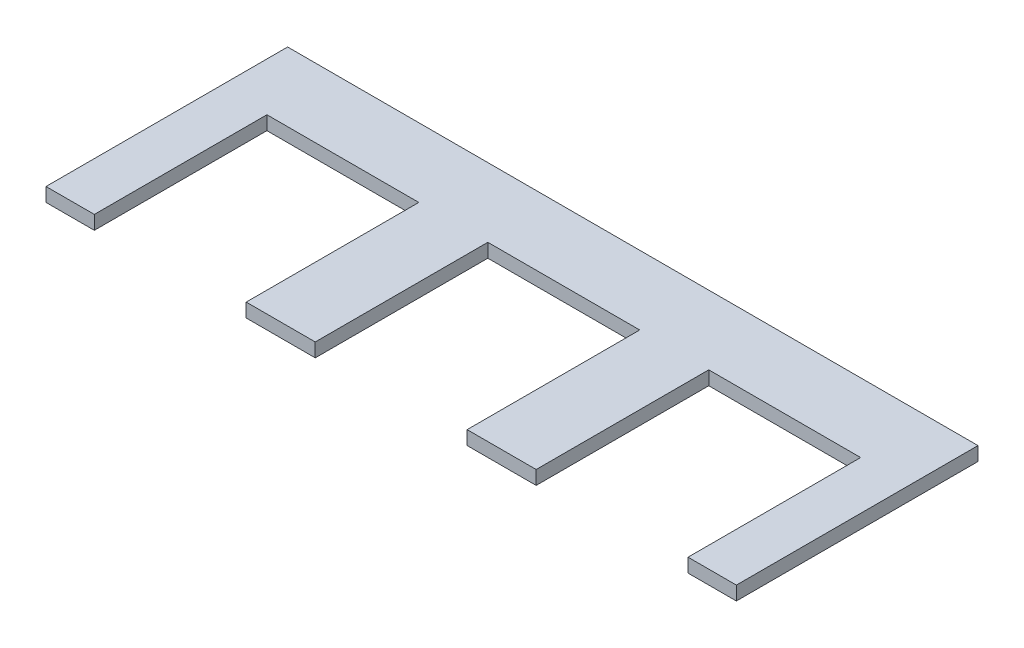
ISO-10303-21;
HEADER;
FILE_DESCRIPTION(('STEP AP214'),'2;1');
FILE_NAME('part.step','',(''),(''),'','','');
FILE_SCHEMA(('AUTOMOTIVE_DESIGN { 1 0 10303 214 1 1 1 1 }'));
ENDSEC;
DATA;
#1=APPLICATION_CONTEXT('core data for automotive mechanical design processes');
#2=APPLICATION_PROTOCOL_DEFINITION('international standard','automotive_design',2000,#1);
#3=PRODUCT_CONTEXT('',#1,'mechanical');
#4=PRODUCT('Part','Part','',(#3));
#5=PRODUCT_RELATED_PRODUCT_CATEGORY('part','',(#4));
#6=PRODUCT_DEFINITION_FORMATION('','',#4);
#7=PRODUCT_DEFINITION_CONTEXT('part definition',#1,'design');
#8=PRODUCT_DEFINITION('design','',#6,#7);
#9=PRODUCT_DEFINITION_SHAPE('','',#8);
#10=(LENGTH_UNIT() NAMED_UNIT(*) SI_UNIT(.MILLI.,.METRE.));
#11=(NAMED_UNIT(*) PLANE_ANGLE_UNIT() SI_UNIT($,.RADIAN.));
#12=(NAMED_UNIT(*) SI_UNIT($,.STERADIAN.) SOLID_ANGLE_UNIT());
#13=UNCERTAINTY_MEASURE_WITH_UNIT(LENGTH_MEASURE(1.E-05),#10,'distance_accuracy_value','');
#14=(GEOMETRIC_REPRESENTATION_CONTEXT(3) GLOBAL_UNCERTAINTY_ASSIGNED_CONTEXT((#13)) GLOBAL_UNIT_ASSIGNED_CONTEXT((#10,
#11,#12)) REPRESENTATION_CONTEXT('',''));
#15=CARTESIAN_POINT('',(0.,0.,0.));
#16=DIRECTION('',(0.,0.,1.));
#17=DIRECTION('',(1.,0.,0.));
#18=AXIS2_PLACEMENT_3D('',#15,#16,#17);
#19=CARTESIAN_POINT('',(-500.,20.,175.));
#20=DIRECTION('',(0.,0.,-1.));
#21=DIRECTION('',(-1.,0.,0.));
#22=AXIS2_PLACEMENT_3D('',#19,#20,#21);
#23=PLANE('',#22);
#24=DIRECTION('',(1.,0.,0.));
#25=VECTOR('',#24,1.);
#26=CARTESIAN_POINT('',(-500.,0.,175.));
#27=LINE('',#26,#25);
#28=CARTESIAN_POINT('',(110.,0.,175.));
#29=VERTEX_POINT('',#28);
#30=CARTESIAN_POINT('',(210.,0.,175.));
#31=VERTEX_POINT('',#30);
#32=EDGE_CURVE('E192',#29,#31,#27,.T.);
#33=ORIENTED_EDGE('',*,*,#32,.T.);
#34=DIRECTION('',(0.,1.,0.));
#35=VECTOR('',#34,1.);
#36=CARTESIAN_POINT('',(210.,0.,175.));
#37=LINE('',#36,#35);
#38=CARTESIAN_POINT('',(210.,20.,175.));
#39=VERTEX_POINT('',#38);
#40=EDGE_CURVE('E273',#31,#39,#37,.T.);
#41=ORIENTED_EDGE('',*,*,#40,.T.);
#42=DIRECTION('',(1.,0.,0.));
#43=VECTOR('',#42,1.);
#44=CARTESIAN_POINT('',(-500.,20.,175.));
#45=LINE('',#44,#43);
#46=CARTESIAN_POINT('',(110.,20.,175.));
#47=VERTEX_POINT('',#46);
#48=EDGE_CURVE('E327',#47,#39,#45,.T.);
#49=ORIENTED_EDGE('',*,*,#48,.F.);
#50=DIRECTION('',(0.,1.,0.));
#51=VECTOR('',#50,1.);
#52=CARTESIAN_POINT('',(110.,0.,175.));
#53=LINE('',#52,#51);
#54=EDGE_CURVE('E231',#29,#47,#53,.T.);
#55=ORIENTED_EDGE('',*,*,#54,.F.);
#56=EDGE_LOOP('',(#33,#41,#49,#55));
#57=FACE_BOUND('',#56,.T.);
#58=ADVANCED_FACE('F39',(#57),#23,.F.);
#59=CARTESIAN_POINT('',(-500.,0.,175.));
#60=VERTEX_POINT('',#59);
#61=CARTESIAN_POINT('',(-430.,0.,175.));
#62=VERTEX_POINT('',#61);
#63=EDGE_CURVE('E171',#60,#62,#27,.T.);
#64=ORIENTED_EDGE('',*,*,#63,.T.);
#65=DIRECTION('',(0.,1.,0.));
#66=VECTOR('',#65,1.);
#67=CARTESIAN_POINT('',(-430.,0.,175.));
#68=LINE('',#67,#66);
#69=CARTESIAN_POINT('',(-430.,20.,175.));
#70=VERTEX_POINT('',#69);
#71=EDGE_CURVE('E153',#62,#70,#68,.T.);
#72=ORIENTED_EDGE('',*,*,#71,.T.);
#73=CARTESIAN_POINT('',(-500.,20.,175.));
#74=VERTEX_POINT('',#73);
#75=EDGE_CURVE('E216',#74,#70,#45,.T.);
#76=ORIENTED_EDGE('',*,*,#75,.F.);
#77=DIRECTION('',(0.,-1.,0.));
#78=VECTOR('',#77,1.);
#79=CARTESIAN_POINT('',(-500.,20.,175.));
#80=LINE('',#79,#78);
#81=EDGE_CURVE('E180',#74,#60,#80,.T.);
#82=ORIENTED_EDGE('',*,*,#81,.T.);
#83=EDGE_LOOP('',(#64,#72,#76,#82));
#84=FACE_BOUND('',#83,.T.);
#85=ADVANCED_FACE('F178',(#84),#23,.F.);
#86=CARTESIAN_POINT('',(-210.,20.,175.));
#87=VERTEX_POINT('',#86);
#88=CARTESIAN_POINT('',(-110.,20.,175.));
#89=VERTEX_POINT('',#88);
#90=EDGE_CURVE('E220',#87,#89,#45,.T.);
#91=ORIENTED_EDGE('',*,*,#90,.F.);
#92=DIRECTION('',(0.,1.,0.));
#93=VECTOR('',#92,1.);
#94=CARTESIAN_POINT('',(-210.,0.,175.));
#95=LINE('',#94,#93);
#96=CARTESIAN_POINT('',(-210.,0.,175.));
#97=VERTEX_POINT('',#96);
#98=EDGE_CURVE('E164',#97,#87,#95,.T.);
#99=ORIENTED_EDGE('',*,*,#98,.F.);
#100=CARTESIAN_POINT('',(-110.,0.,175.));
#101=VERTEX_POINT('',#100);
#102=EDGE_CURVE('E183',#97,#101,#27,.T.);
#103=ORIENTED_EDGE('',*,*,#102,.T.);
#104=DIRECTION('',(0.,1.,0.));
#105=VECTOR('',#104,1.);
#106=CARTESIAN_POINT('',(-110.,0.,175.));
#107=LINE('',#106,#105);
#108=EDGE_CURVE('E227',#101,#89,#107,.T.);
#109=ORIENTED_EDGE('',*,*,#108,.T.);
#110=EDGE_LOOP('',(#91,#99,#103,#109));
#111=FACE_BOUND('',#110,.T.);
#112=ADVANCED_FACE('F322',(#111),#23,.F.);
#113=CARTESIAN_POINT('',(500.,20.,175.));
#114=DIRECTION('',(-1.,0.,0.));
#115=DIRECTION('',(0.,0.,1.));
#116=AXIS2_PLACEMENT_3D('',#113,#114,#115);
#117=PLANE('',#116);
#118=DIRECTION('',(0.,0.,-1.));
#119=VECTOR('',#118,1.);
#120=CARTESIAN_POINT('',(500.,0.,175.));
#121=LINE('',#120,#119);
#122=CARTESIAN_POINT('',(500.,0.,175.));
#123=VERTEX_POINT('',#122);
#124=CARTESIAN_POINT('',(500.,0.,-175.));
#125=VERTEX_POINT('',#124);
#126=EDGE_CURVE('E209',#123,#125,#121,.T.);
#127=ORIENTED_EDGE('',*,*,#126,.T.);
#128=DIRECTION('',(0.,-1.,0.));
#129=VECTOR('',#128,1.);
#130=CARTESIAN_POINT('',(500.,20.,-175.));
#131=LINE('',#130,#129);
#132=CARTESIAN_POINT('',(500.,20.,-175.));
#133=VERTEX_POINT('',#132);
#134=EDGE_CURVE('E11',#133,#125,#131,.T.);
#135=ORIENTED_EDGE('',*,*,#134,.F.);
#136=DIRECTION('',(0.,0.,-1.));
#137=VECTOR('',#136,1.);
#138=CARTESIAN_POINT('',(500.,20.,175.));
#139=LINE('',#138,#137);
#140=CARTESIAN_POINT('',(500.,20.,175.));
#141=VERTEX_POINT('',#140);
#142=EDGE_CURVE('E182',#141,#133,#139,.T.);
#143=ORIENTED_EDGE('',*,*,#142,.F.);
#144=DIRECTION('',(0.,-1.,0.));
#145=VECTOR('',#144,1.);
#146=CARTESIAN_POINT('',(500.,20.,175.));
#147=LINE('',#146,#145);
#148=EDGE_CURVE('E219',#141,#123,#147,.T.);
#149=ORIENTED_EDGE('',*,*,#148,.T.);
#150=EDGE_LOOP('',(#127,#135,#143,#149));
#151=FACE_BOUND('',#150,.T.);
#152=ADVANCED_FACE('F41',(#151),#117,.F.);
#153=CARTESIAN_POINT('',(-500.,20.,-175.));
#154=DIRECTION('',(0.,0.,1.));
#155=DIRECTION('',(1.,0.,0.));
#156=AXIS2_PLACEMENT_3D('',#153,#154,#155);
#157=PLANE('',#156);
#158=DIRECTION('',(-1.,0.,0.));
#159=VECTOR('',#158,1.);
#160=CARTESIAN_POINT('',(-500.,0.,-175.));
#161=LINE('',#160,#159);
#162=CARTESIAN_POINT('',(-500.,0.,-175.));
#163=VERTEX_POINT('',#162);
#164=EDGE_CURVE('E205',#125,#163,#161,.T.);
#165=ORIENTED_EDGE('',*,*,#164,.T.);
#166=DIRECTION('',(0.,-1.,0.));
#167=VECTOR('',#166,1.);
#168=CARTESIAN_POINT('',(-500.,20.,-175.));
#169=LINE('',#168,#167);
#170=CARTESIAN_POINT('',(-500.,20.,-175.));
#171=VERTEX_POINT('',#170);
#172=EDGE_CURVE('E48',#171,#163,#169,.T.);
#173=ORIENTED_EDGE('',*,*,#172,.F.);
#174=DIRECTION('',(-1.,0.,0.));
#175=VECTOR('',#174,1.);
#176=CARTESIAN_POINT('',(-500.,20.,-175.));
#177=LINE('',#176,#175);
#178=EDGE_CURVE('E189',#133,#171,#177,.T.);
#179=ORIENTED_EDGE('',*,*,#178,.F.);
#180=ORIENTED_EDGE('',*,*,#134,.T.);
#181=EDGE_LOOP('',(#165,#173,#179,#180));
#182=FACE_BOUND('',#181,.T.);
#183=ADVANCED_FACE('F345',(#182),#157,.F.);
#184=CARTESIAN_POINT('',(-500.,20.,175.));
#185=DIRECTION('',(1.,0.,0.));
#186=DIRECTION('',(0.,0.,-1.));
#187=AXIS2_PLACEMENT_3D('',#184,#185,#186);
#188=PLANE('',#187);
#189=DIRECTION('',(0.,0.,1.));
#190=VECTOR('',#189,1.);
#191=CARTESIAN_POINT('',(-500.,0.,175.));
#192=LINE('',#191,#190);
#193=EDGE_CURVE('E196',#163,#60,#192,.T.);
#194=ORIENTED_EDGE('',*,*,#193,.T.);
#195=ORIENTED_EDGE('',*,*,#81,.F.);
#196=DIRECTION('',(0.,0.,1.));
#197=VECTOR('',#196,1.);
#198=CARTESIAN_POINT('',(-500.,20.,175.));
#199=LINE('',#198,#197);
#200=EDGE_CURVE('E222',#171,#74,#199,.T.);
#201=ORIENTED_EDGE('',*,*,#200,.F.);
#202=ORIENTED_EDGE('',*,*,#172,.T.);
#203=EDGE_LOOP('',(#194,#195,#201,#202));
#204=FACE_BOUND('',#203,.T.);
#205=ADVANCED_FACE('F348',(#204),#188,.F.);
#206=CARTESIAN_POINT('',(430.,20.,175.));
#207=VERTEX_POINT('',#206);
#208=EDGE_CURVE('E221',#207,#141,#45,.T.);
#209=ORIENTED_EDGE('',*,*,#208,.F.);
#210=DIRECTION('',(0.,1.,0.));
#211=VECTOR('',#210,1.);
#212=CARTESIAN_POINT('',(430.,0.,175.));
#213=LINE('',#212,#211);
#214=CARTESIAN_POINT('',(430.,0.,175.));
#215=VERTEX_POINT('',#214);
#216=EDGE_CURVE('E263',#215,#207,#213,.T.);
#217=ORIENTED_EDGE('',*,*,#216,.F.);
#218=EDGE_CURVE('E185',#215,#123,#27,.T.);
#219=ORIENTED_EDGE('',*,*,#218,.T.);
#220=ORIENTED_EDGE('',*,*,#148,.F.);
#221=EDGE_LOOP('',(#209,#217,#219,#220));
#222=FACE_BOUND('',#221,.T.);
#223=ADVANCED_FACE('F340',(#222),#23,.F.);
#224=CARTESIAN_POINT('',(0.,20.,0.));
#225=DIRECTION('',(0.,-1.,0.));
#226=DIRECTION('',(0.,0.,-1.));
#227=AXIS2_PLACEMENT_3D('',#224,#225,#226);
#228=PLANE('',#227);
#229=ORIENTED_EDGE('',*,*,#48,.T.);
#230=DIRECTION('',(0.,0.,1.));
#231=VECTOR('',#230,1.);
#232=CARTESIAN_POINT('',(210.,20.,175.));
#233=LINE('',#232,#231);
#234=CARTESIAN_POINT('',(210.,20.,-75.));
#235=VERTEX_POINT('',#234);
#236=EDGE_CURVE('E277',#235,#39,#233,.T.);
#237=ORIENTED_EDGE('',*,*,#236,.F.);
#238=DIRECTION('',(-1.,0.,0.));
#239=VECTOR('',#238,1.);
#240=CARTESIAN_POINT('',(430.,20.,-75.0000000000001));
#241=LINE('',#240,#239);
#242=CARTESIAN_POINT('',(430.,20.,-75.0000000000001));
#243=VERTEX_POINT('',#242);
#244=EDGE_CURVE('E281',#243,#235,#241,.T.);
#245=ORIENTED_EDGE('',*,*,#244,.F.);
#246=DIRECTION('',(0.,0.,-1.));
#247=VECTOR('',#246,1.);
#248=CARTESIAN_POINT('',(430.,20.,175.));
#249=LINE('',#248,#247);
#250=EDGE_CURVE('E285',#207,#243,#249,.T.);
#251=ORIENTED_EDGE('',*,*,#250,.F.);
#252=ORIENTED_EDGE('',*,*,#208,.T.);
#253=ORIENTED_EDGE('',*,*,#142,.T.);
#254=ORIENTED_EDGE('',*,*,#178,.T.);
#255=ORIENTED_EDGE('',*,*,#200,.T.);
#256=ORIENTED_EDGE('',*,*,#75,.T.);
#257=DIRECTION('',(0.,0.,1.));
#258=VECTOR('',#257,1.);
#259=CARTESIAN_POINT('',(-430.,20.,175.));
#260=LINE('',#259,#258);
#261=CARTESIAN_POINT('',(-430.,20.,-75.));
#262=VERTEX_POINT('',#261);
#263=EDGE_CURVE('E158',#262,#70,#260,.T.);
#264=ORIENTED_EDGE('',*,*,#263,.F.);
#265=DIRECTION('',(-1.,0.,0.));
#266=VECTOR('',#265,1.);
#267=CARTESIAN_POINT('',(-430.,20.,-75.));
#268=LINE('',#267,#266);
#269=CARTESIAN_POINT('',(-210.,20.,-75.));
#270=VERTEX_POINT('',#269);
#271=EDGE_CURVE('E175',#270,#262,#268,.T.);
#272=ORIENTED_EDGE('',*,*,#271,.F.);
#273=DIRECTION('',(0.,0.,-1.));
#274=VECTOR('',#273,1.);
#275=CARTESIAN_POINT('',(-210.,20.,175.));
#276=LINE('',#275,#274);
#277=EDGE_CURVE('E306',#87,#270,#276,.T.);
#278=ORIENTED_EDGE('',*,*,#277,.F.);
#279=ORIENTED_EDGE('',*,*,#90,.T.);
#280=DIRECTION('',(0.,0.,1.));
#281=VECTOR('',#280,1.);
#282=CARTESIAN_POINT('',(-110.,20.,175.));
#283=LINE('',#282,#281);
#284=CARTESIAN_POINT('',(-110.,20.,-74.9999999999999));
#285=VERTEX_POINT('',#284);
#286=EDGE_CURVE('E249',#285,#89,#283,.T.);
#287=ORIENTED_EDGE('',*,*,#286,.F.);
#288=DIRECTION('',(-1.,0.,0.));
#289=VECTOR('',#288,1.);
#290=CARTESIAN_POINT('',(-110.,20.,-74.9999999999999));
#291=LINE('',#290,#289);
#292=CARTESIAN_POINT('',(110.,20.,-75.));
#293=VERTEX_POINT('',#292);
#294=EDGE_CURVE('E240',#293,#285,#291,.T.);
#295=ORIENTED_EDGE('',*,*,#294,.F.);
#296=DIRECTION('',(0.,0.,-1.));
#297=VECTOR('',#296,1.);
#298=CARTESIAN_POINT('',(110.,20.,175.));
#299=LINE('',#298,#297);
#300=EDGE_CURVE('E245',#47,#293,#299,.T.);
#301=ORIENTED_EDGE('',*,*,#300,.F.);
#302=EDGE_LOOP('',(#229,#237,#245,#251,#252,#253,#254,#255,#256,#264,#272,#278,#279,#287,#295,#301));
#303=FACE_BOUND('',#302,.T.);
#304=ADVANCED_FACE('F336',(#303),#228,.F.);
#305=CARTESIAN_POINT('',(0.,0.,0.));
#306=DIRECTION('',(0.,-1.,0.));
#307=DIRECTION('',(0.,0.,-1.));
#308=AXIS2_PLACEMENT_3D('',#305,#306,#307);
#309=PLANE('',#308);
#310=DIRECTION('',(0.,0.,1.));
#311=VECTOR('',#310,1.);
#312=CARTESIAN_POINT('',(210.,0.,175.));
#313=LINE('',#312,#311);
#314=CARTESIAN_POINT('',(210.,0.,-75.));
#315=VERTEX_POINT('',#314);
#316=EDGE_CURVE('E267',#315,#31,#313,.T.);
#317=ORIENTED_EDGE('',*,*,#316,.T.);
#318=ORIENTED_EDGE('',*,*,#32,.F.);
#319=DIRECTION('',(0.,0.,-1.));
#320=VECTOR('',#319,1.);
#321=CARTESIAN_POINT('',(110.,0.,175.));
#322=LINE('',#321,#320);
#323=CARTESIAN_POINT('',(110.,0.,-75.));
#324=VERTEX_POINT('',#323);
#325=EDGE_CURVE('E256',#29,#324,#322,.T.);
#326=ORIENTED_EDGE('',*,*,#325,.T.);
#327=DIRECTION('',(-1.,0.,0.));
#328=VECTOR('',#327,1.);
#329=CARTESIAN_POINT('',(-110.,0.,-74.9999999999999));
#330=LINE('',#329,#328);
#331=CARTESIAN_POINT('',(-110.,0.,-74.9999999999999));
#332=VERTEX_POINT('',#331);
#333=EDGE_CURVE('E232',#324,#332,#330,.T.);
#334=ORIENTED_EDGE('',*,*,#333,.T.);
#335=DIRECTION('',(0.,0.,1.));
#336=VECTOR('',#335,1.);
#337=CARTESIAN_POINT('',(-110.,0.,175.));
#338=LINE('',#337,#336);
#339=EDGE_CURVE('E244',#332,#101,#338,.T.);
#340=ORIENTED_EDGE('',*,*,#339,.T.);
#341=ORIENTED_EDGE('',*,*,#102,.F.);
#342=DIRECTION('',(0.,0.,-1.));
#343=VECTOR('',#342,1.);
#344=CARTESIAN_POINT('',(-210.,0.,175.));
#345=LINE('',#344,#343);
#346=CARTESIAN_POINT('',(-210.,0.,-75.));
#347=VERTEX_POINT('',#346);
#348=EDGE_CURVE('E174',#97,#347,#345,.T.);
#349=ORIENTED_EDGE('',*,*,#348,.T.);
#350=DIRECTION('',(-1.,0.,0.));
#351=VECTOR('',#350,1.);
#352=CARTESIAN_POINT('',(-430.,0.,-75.));
#353=LINE('',#352,#351);
#354=CARTESIAN_POINT('',(-430.,0.,-75.));
#355=VERTEX_POINT('',#354);
#356=EDGE_CURVE('E63',#347,#355,#353,.T.);
#357=ORIENTED_EDGE('',*,*,#356,.T.);
#358=DIRECTION('',(0.,0.,1.));
#359=VECTOR('',#358,1.);
#360=CARTESIAN_POINT('',(-430.,0.,175.));
#361=LINE('',#360,#359);
#362=EDGE_CURVE('E156',#355,#62,#361,.T.);
#363=ORIENTED_EDGE('',*,*,#362,.T.);
#364=ORIENTED_EDGE('',*,*,#63,.F.);
#365=ORIENTED_EDGE('',*,*,#193,.F.);
#366=ORIENTED_EDGE('',*,*,#164,.F.);
#367=ORIENTED_EDGE('',*,*,#126,.F.);
#368=ORIENTED_EDGE('',*,*,#218,.F.);
#369=DIRECTION('',(0.,0.,-1.));
#370=VECTOR('',#369,1.);
#371=CARTESIAN_POINT('',(430.,0.,175.));
#372=LINE('',#371,#370);
#373=CARTESIAN_POINT('',(430.,0.,-75.0000000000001));
#374=VERTEX_POINT('',#373);
#375=EDGE_CURVE('E280',#215,#374,#372,.T.);
#376=ORIENTED_EDGE('',*,*,#375,.T.);
#377=DIRECTION('',(-1.,0.,0.));
#378=VECTOR('',#377,1.);
#379=CARTESIAN_POINT('',(430.,0.,-75.0000000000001));
#380=LINE('',#379,#378);
#381=EDGE_CURVE('E55',#374,#315,#380,.T.);
#382=ORIENTED_EDGE('',*,*,#381,.T.);
#383=EDGE_LOOP('',(#317,#318,#326,#334,#340,#341,#349,#357,#363,#364,#365,#366,#367,#368,#376,#382));
#384=FACE_BOUND('',#383,.T.);
#385=ADVANCED_FACE('F169',(#384),#309,.T.);
#386=CARTESIAN_POINT('',(-110.,0.,175.));
#387=DIRECTION('',(-1.,0.,0.));
#388=DIRECTION('',(0.,0.,1.));
#389=AXIS2_PLACEMENT_3D('',#386,#387,#388);
#390=PLANE('',#389);
#391=ORIENTED_EDGE('',*,*,#286,.T.);
#392=ORIENTED_EDGE('',*,*,#108,.F.);
#393=ORIENTED_EDGE('',*,*,#339,.F.);
#394=DIRECTION('',(0.,1.,0.));
#395=VECTOR('',#394,1.);
#396=CARTESIAN_POINT('',(-110.,0.,-74.9999999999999));
#397=LINE('',#396,#395);
#398=EDGE_CURVE('E215',#332,#285,#397,.T.);
#399=ORIENTED_EDGE('',*,*,#398,.T.);
#400=EDGE_LOOP('',(#391,#392,#393,#399));
#401=FACE_BOUND('',#400,.T.);
#402=ADVANCED_FACE('F369',(#401),#390,.F.);
#403=CARTESIAN_POINT('',(-110.,0.,-74.9999999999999));
#404=DIRECTION('',(0.,0.,-1.));
#405=DIRECTION('',(-1.,0.,0.));
#406=AXIS2_PLACEMENT_3D('',#403,#404,#405);
#407=PLANE('',#406);
#408=ORIENTED_EDGE('',*,*,#294,.T.);
#409=ORIENTED_EDGE('',*,*,#398,.F.);
#410=ORIENTED_EDGE('',*,*,#333,.F.);
#411=DIRECTION('',(0.,1.,0.));
#412=VECTOR('',#411,1.);
#413=CARTESIAN_POINT('',(110.,0.,-75.));
#414=LINE('',#413,#412);
#415=EDGE_CURVE('E235',#324,#293,#414,.T.);
#416=ORIENTED_EDGE('',*,*,#415,.T.);
#417=EDGE_LOOP('',(#408,#409,#410,#416));
#418=FACE_BOUND('',#417,.T.);
#419=ADVANCED_FACE('F366',(#418),#407,.F.);
#420=CARTESIAN_POINT('',(110.,0.,175.));
#421=DIRECTION('',(1.,0.,0.));
#422=DIRECTION('',(0.,0.,-1.));
#423=AXIS2_PLACEMENT_3D('',#420,#421,#422);
#424=PLANE('',#423);
#425=ORIENTED_EDGE('',*,*,#300,.T.);
#426=ORIENTED_EDGE('',*,*,#415,.F.);
#427=ORIENTED_EDGE('',*,*,#325,.F.);
#428=ORIENTED_EDGE('',*,*,#54,.T.);
#429=EDGE_LOOP('',(#425,#426,#427,#428));
#430=FACE_BOUND('',#429,.T.);
#431=ADVANCED_FACE('F363',(#430),#424,.F.);
#432=CARTESIAN_POINT('',(-430.,0.,175.));
#433=DIRECTION('',(-1.,0.,0.));
#434=DIRECTION('',(0.,0.,1.));
#435=AXIS2_PLACEMENT_3D('',#432,#433,#434);
#436=PLANE('',#435);
#437=ORIENTED_EDGE('',*,*,#263,.T.);
#438=ORIENTED_EDGE('',*,*,#71,.F.);
#439=ORIENTED_EDGE('',*,*,#362,.F.);
#440=DIRECTION('',(0.,1.,0.));
#441=VECTOR('',#440,1.);
#442=CARTESIAN_POINT('',(-430.,0.,-75.));
#443=LINE('',#442,#441);
#444=EDGE_CURVE('E252',#355,#262,#443,.T.);
#445=ORIENTED_EDGE('',*,*,#444,.T.);
#446=EDGE_LOOP('',(#437,#438,#439,#445));
#447=FACE_BOUND('',#446,.T.);
#448=ADVANCED_FACE('F155',(#447),#436,.F.);
#449=CARTESIAN_POINT('',(-430.,0.,-75.));
#450=DIRECTION('',(0.,0.,-1.));
#451=DIRECTION('',(-1.,0.,0.));
#452=AXIS2_PLACEMENT_3D('',#449,#450,#451);
#453=PLANE('',#452);
#454=ORIENTED_EDGE('',*,*,#271,.T.);
#455=ORIENTED_EDGE('',*,*,#444,.F.);
#456=ORIENTED_EDGE('',*,*,#356,.F.);
#457=DIRECTION('',(0.,1.,0.));
#458=VECTOR('',#457,1.);
#459=CARTESIAN_POINT('',(-210.,0.,-75.));
#460=LINE('',#459,#458);
#461=EDGE_CURVE('E298',#347,#270,#460,.T.);
#462=ORIENTED_EDGE('',*,*,#461,.T.);
#463=EDGE_LOOP('',(#454,#455,#456,#462));
#464=FACE_BOUND('',#463,.T.);
#465=ADVANCED_FACE('F460',(#464),#453,.F.);
#466=CARTESIAN_POINT('',(-210.,0.,175.));
#467=DIRECTION('',(1.,0.,0.));
#468=DIRECTION('',(0.,0.,-1.));
#469=AXIS2_PLACEMENT_3D('',#466,#467,#468);
#470=PLANE('',#469);
#471=ORIENTED_EDGE('',*,*,#277,.T.);
#472=ORIENTED_EDGE('',*,*,#461,.F.);
#473=ORIENTED_EDGE('',*,*,#348,.F.);
#474=ORIENTED_EDGE('',*,*,#98,.T.);
#475=EDGE_LOOP('',(#471,#472,#473,#474));
#476=FACE_BOUND('',#475,.T.);
#477=ADVANCED_FACE('F318',(#476),#470,.F.);
#478=CARTESIAN_POINT('',(210.,0.,175.));
#479=DIRECTION('',(-1.,0.,0.));
#480=DIRECTION('',(0.,0.,1.));
#481=AXIS2_PLACEMENT_3D('',#478,#479,#480);
#482=PLANE('',#481);
#483=ORIENTED_EDGE('',*,*,#236,.T.);
#484=ORIENTED_EDGE('',*,*,#40,.F.);
#485=ORIENTED_EDGE('',*,*,#316,.F.);
#486=DIRECTION('',(0.,1.,0.));
#487=VECTOR('',#486,1.);
#488=CARTESIAN_POINT('',(210.,0.,-75.));
#489=LINE('',#488,#487);
#490=EDGE_CURVE('E270',#315,#235,#489,.T.);
#491=ORIENTED_EDGE('',*,*,#490,.T.);
#492=EDGE_LOOP('',(#483,#484,#485,#491));
#493=FACE_BOUND('',#492,.T.);
#494=ADVANCED_FACE('F357',(#493),#482,.F.);
#495=CARTESIAN_POINT('',(430.,0.,-75.0000000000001));
#496=DIRECTION('',(0.,0.,-1.));
#497=DIRECTION('',(-1.,0.,0.));
#498=AXIS2_PLACEMENT_3D('',#495,#496,#497);
#499=PLANE('',#498);
#500=ORIENTED_EDGE('',*,*,#244,.T.);
#501=ORIENTED_EDGE('',*,*,#490,.F.);
#502=ORIENTED_EDGE('',*,*,#381,.F.);
#503=DIRECTION('',(0.,1.,0.));
#504=VECTOR('',#503,1.);
#505=CARTESIAN_POINT('',(430.,0.,-75.0000000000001));
#506=LINE('',#505,#504);
#507=EDGE_CURVE('E266',#374,#243,#506,.T.);
#508=ORIENTED_EDGE('',*,*,#507,.T.);
#509=EDGE_LOOP('',(#500,#501,#502,#508));
#510=FACE_BOUND('',#509,.T.);
#511=ADVANCED_FACE('F354',(#510),#499,.F.);
#512=CARTESIAN_POINT('',(430.,0.,175.));
#513=DIRECTION('',(1.,0.,0.));
#514=DIRECTION('',(0.,0.,-1.));
#515=AXIS2_PLACEMENT_3D('',#512,#513,#514);
#516=PLANE('',#515);
#517=ORIENTED_EDGE('',*,*,#250,.T.);
#518=ORIENTED_EDGE('',*,*,#507,.F.);
#519=ORIENTED_EDGE('',*,*,#375,.F.);
#520=ORIENTED_EDGE('',*,*,#216,.T.);
#521=EDGE_LOOP('',(#517,#518,#519,#520));
#522=FACE_BOUND('',#521,.T.);
#523=ADVANCED_FACE('F353',(#522),#516,.F.);
#524=CLOSED_SHELL('',(#58,#85,#112,#152,#183,#205,#223,#304,#385,#402,#419,#431,#448,#465,#477,
#494,#511,#523));
#525=MANIFOLD_SOLID_BREP('B2',#524);
#526=ADVANCED_BREP_SHAPE_REPRESENTATION('',(#18,#525),#14);
#527=SHAPE_DEFINITION_REPRESENTATION(#9,#526);
ENDSEC;
END-ISO-10303-21;
